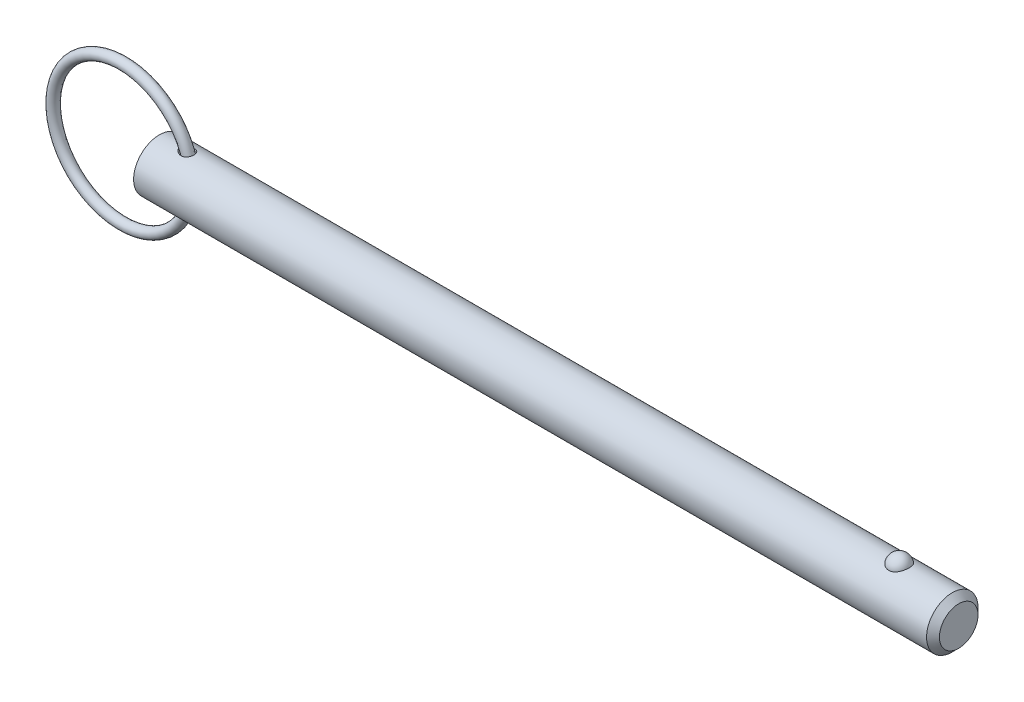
ISO-10303-21;
HEADER;
FILE_DESCRIPTION(('STEP AP214'),'2;1');
FILE_NAME('part.step','',(''),(''),'','','');
FILE_SCHEMA(('AUTOMOTIVE_DESIGN { 1 0 10303 214 1 1 1 1 }'));
ENDSEC;
DATA;
#1=APPLICATION_CONTEXT('core data for automotive mechanical design processes');
#2=APPLICATION_PROTOCOL_DEFINITION('international standard','automotive_design',2000,#1);
#3=PRODUCT_CONTEXT('',#1,'mechanical');
#4=PRODUCT('Part','Part','',(#3));
#5=PRODUCT_RELATED_PRODUCT_CATEGORY('part','',(#4));
#6=PRODUCT_DEFINITION_FORMATION('','',#4);
#7=PRODUCT_DEFINITION_CONTEXT('part definition',#1,'design');
#8=PRODUCT_DEFINITION('design','',#6,#7);
#9=PRODUCT_DEFINITION_SHAPE('','',#8);
#10=(LENGTH_UNIT() NAMED_UNIT(*) SI_UNIT(.MILLI.,.METRE.));
#11=(NAMED_UNIT(*) PLANE_ANGLE_UNIT() SI_UNIT($,.RADIAN.));
#12=(NAMED_UNIT(*) SI_UNIT($,.STERADIAN.) SOLID_ANGLE_UNIT());
#13=UNCERTAINTY_MEASURE_WITH_UNIT(LENGTH_MEASURE(1.E-05),#10,'distance_accuracy_value','');
#14=(GEOMETRIC_REPRESENTATION_CONTEXT(3) GLOBAL_UNCERTAINTY_ASSIGNED_CONTEXT((#13)) GLOBAL_UNIT_ASSIGNED_CONTEXT((#10,
#11,#12)) REPRESENTATION_CONTEXT('',''));
#15=CARTESIAN_POINT('',(0.,0.,0.));
#16=DIRECTION('',(0.,0.,1.));
#17=DIRECTION('',(1.,0.,0.));
#18=AXIS2_PLACEMENT_3D('',#15,#16,#17);
#19=CARTESIAN_POINT('',(-6.70471658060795,0.,0.));
#20=DIRECTION('',(0.,0.,1.));
#21=DIRECTION('',(1.,0.,0.));
#22=AXIS2_PLACEMENT_3D('',#19,#20,#21);
#23=TOROIDAL_SURFACE('',#22,12.7,0.940000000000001);
#24=CARTESIAN_POINT('',(6.93528341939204,0.,0.));
#25=VERTEX_POINT('',#24);
#26=VERTEX_LOOP('',#25);
#27=FACE_BOUND('',#26,.T.);
#28=ADVANCED_FACE('P0_F12',(#27),#23,.T.);
#29=CLOSED_SHELL('',(#28));
#30=MANIFOLD_SOLID_BREP('P0_B1',#29);
#31=CARTESIAN_POINT('',(0.,0.,0.));
#32=DIRECTION('',(1.,0.,0.));
#33=DIRECTION('',(0.,0.,-1.));
#34=AXIS2_PLACEMENT_3D('',#31,#32,#33);
#35=CYLINDRICAL_SURFACE('',#34,4.7);
#36=CARTESIAN_POINT('',(4.16378072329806,4.63584137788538,-0.773934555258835));
#37=CARTESIAN_POINT('',(4.22041228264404,4.62659903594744,-0.829297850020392));
#38=CARTESIAN_POINT('',(4.28206987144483,4.61719767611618,-0.87952289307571));
#39=CARTESIAN_POINT('',(4.41303152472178,4.59925351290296,-0.968997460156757));
#40=CARTESIAN_POINT('',(4.48234424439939,4.59071170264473,-1.00823437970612));
#41=CARTESIAN_POINT('',(4.62650734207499,4.5755493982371,-1.07495006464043));
#42=CARTESIAN_POINT('',(4.70135029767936,4.56892638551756,-1.10244426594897));
#43=CARTESIAN_POINT('',(4.85470490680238,4.55848940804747,-1.14483874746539));
#44=CARTESIAN_POINT('',(4.93321503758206,4.55467428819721,-1.15974420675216));
#45=CARTESIAN_POINT('',(5.09197970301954,4.55051176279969,-1.17597559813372));
#46=CARTESIAN_POINT('',(5.17223836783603,4.55017372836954,-1.17726483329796));
#47=CARTESIAN_POINT('',(5.33159446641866,4.55326696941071,-1.16524823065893));
#48=CARTESIAN_POINT('',(5.41069268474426,4.55669556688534,-1.15195276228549));
#49=CARTESIAN_POINT('',(5.55698758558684,4.56647801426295,-1.11249214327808));
#50=CARTESIAN_POINT('',(5.62458628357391,4.57250771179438,-1.08773548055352));
#51=CARTESIAN_POINT('',(5.7539770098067,4.58665356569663,-1.02644632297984));
#52=CARTESIAN_POINT('',(5.81577171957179,4.59476875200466,-0.989919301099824));
#53=CARTESIAN_POINT('',(5.92681484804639,4.61135052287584,-0.90939126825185));
#54=CARTESIAN_POINT('',(5.97666790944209,4.61973919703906,-0.866204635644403));
#55=CARTESIAN_POINT('',(6.06817854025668,4.63643253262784,-0.771868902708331));
#56=CARTESIAN_POINT('',(6.10983710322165,4.64473720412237,-0.720720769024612));
#57=CARTESIAN_POINT('',(6.18318089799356,4.660174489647,-0.612928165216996));
#58=CARTESIAN_POINT('',(6.21503150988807,4.66732544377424,-0.55639864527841));
#59=CARTESIAN_POINT('',(6.26900210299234,4.67985590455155,-0.438689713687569));
#60=CARTESIAN_POINT('',(6.29112194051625,4.68523538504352,-0.377510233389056));
#61=CARTESIAN_POINT('',(6.3252384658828,4.6936733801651,-0.251831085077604));
#62=CARTESIAN_POINT('',(6.33717189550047,4.69671737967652,-0.187313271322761));
#63=CARTESIAN_POINT('',(6.35042407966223,4.70010386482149,-0.0571258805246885));
#64=CARTESIAN_POINT('',(6.3517424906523,4.70044626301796,0.00854373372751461));
#65=CARTESIAN_POINT('',(6.34371729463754,4.69838816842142,0.139481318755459));
#66=CARTESIAN_POINT('',(6.33432596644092,4.69597539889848,0.204746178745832));
#67=CARTESIAN_POINT('',(6.30500866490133,4.68864655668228,0.332720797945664));
#68=CARTESIAN_POINT('',(6.28508259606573,4.68373046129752,0.395430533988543));
#69=CARTESIAN_POINT('',(6.23516511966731,4.67193431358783,0.516455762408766));
#70=CARTESIAN_POINT('',(6.20518126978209,4.66505573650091,0.574774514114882));
#71=CARTESIAN_POINT('',(6.1358631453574,4.65009270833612,0.685387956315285));
#72=CARTESIAN_POINT('',(6.09652950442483,4.64200833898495,0.737683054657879));
#73=CARTESIAN_POINT('',(6.00979078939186,4.62559001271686,0.834455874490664));
#74=CARTESIAN_POINT('',(5.96243625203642,4.61725787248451,0.878979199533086));
#75=CARTESIAN_POINT('',(5.86079843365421,4.60122574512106,0.959378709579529));
#76=CARTESIAN_POINT('',(5.80651591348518,4.59352568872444,0.995255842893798));
#77=CARTESIAN_POINT('',(5.69277386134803,4.57961669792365,1.05741527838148));
#78=CARTESIAN_POINT('',(5.63333134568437,4.57340309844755,1.08372773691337));
#79=CARTESIAN_POINT('',(5.5108424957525,4.56305640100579,1.12650026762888));
#80=CARTESIAN_POINT('',(5.44779577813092,4.55892352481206,1.14295928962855));
#81=CARTESIAN_POINT('',(5.3179566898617,4.55299444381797,1.1663590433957));
#82=CARTESIAN_POINT('',(5.25110869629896,4.55127026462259,1.17300670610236));
#83=CARTESIAN_POINT('',(5.11716812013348,4.55043953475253,1.17622268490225));
#84=CARTESIAN_POINT('',(5.05007546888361,4.55133378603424,1.17278791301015));
#85=CARTESIAN_POINT('',(4.91166083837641,4.55569951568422,1.15571913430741));
#86=CARTESIAN_POINT('',(4.84044690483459,4.55937764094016,1.1412666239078));
#87=CARTESIAN_POINT('',(4.70108819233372,4.56903562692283,1.10196123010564));
#88=CARTESIAN_POINT('',(4.63294574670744,4.57501720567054,1.07710058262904));
#89=CARTESIAN_POINT('',(4.4947730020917,4.58927184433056,1.01474439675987));
#90=CARTESIAN_POINT('',(4.42520748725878,4.59771156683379,0.976252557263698));
#91=CARTESIAN_POINT('',(4.29354165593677,4.61552030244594,0.888246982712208));
#92=CARTESIAN_POINT('',(4.23143936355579,4.62488906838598,0.838736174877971));
#93=CARTESIAN_POINT('',(4.12609666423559,4.64192969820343,0.738015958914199));
#94=CARTESIAN_POINT('',(4.08142630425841,4.64963595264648,0.68830869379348));
#95=CARTESIAN_POINT('',(4.0008117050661,4.66411457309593,0.582144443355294));
#96=CARTESIAN_POINT('',(3.96485623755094,4.6708881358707,0.525696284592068));
#97=CARTESIAN_POINT('',(3.90818393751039,4.68183565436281,0.415917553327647));
#98=CARTESIAN_POINT('',(3.88599581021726,4.68624644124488,0.363372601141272));
#99=CARTESIAN_POINT('',(3.85055971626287,4.693376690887,0.255230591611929));
#100=CARTESIAN_POINT('',(3.83730635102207,4.69609717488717,0.199635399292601));
#101=CARTESIAN_POINT('',(3.82058225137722,4.69954043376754,0.0867104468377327));
#102=CARTESIAN_POINT('',(3.81714632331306,4.70025610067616,0.0293752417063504));
#103=CARTESIAN_POINT('',(3.8204140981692,4.69957935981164,-0.0849928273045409));
#104=CARTESIAN_POINT('',(3.82711802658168,4.69818690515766,-0.14202568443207));
#105=CARTESIAN_POINT('',(3.84950128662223,4.69360426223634,-0.250744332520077));
#106=CARTESIAN_POINT('',(3.8646389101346,4.69052274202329,-0.302548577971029));
#107=CARTESIAN_POINT('',(3.90261190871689,4.68295207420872,-0.403121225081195));
#108=CARTESIAN_POINT('',(3.92544863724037,4.67846267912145,-0.451889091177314));
#109=CARTESIAN_POINT('',(3.97999306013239,4.6680441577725,-0.549522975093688));
#110=CARTESIAN_POINT('',(4.01228648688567,4.66202553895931,-0.598050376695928));
#111=CARTESIAN_POINT('',(4.08340845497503,4.64931397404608,-0.689954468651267));
#112=CARTESIAN_POINT('',(4.12224260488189,4.64262045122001,-0.733326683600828));
#113=CARTESIAN_POINT('',(4.16378072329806,4.63584137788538,-0.773934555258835));
#114=B_SPLINE_CURVE_WITH_KNOTS('',3,(#36,#37,#38,#39,#40,#41,#42,#43,#44,#45,#46,#47,#48,#49,
#50,#51,#52,#53,#54,#55,#56,#57,#58,#59,#60,#61,#62,#63,#64,#65,#66,#67,#68,#69,#70,#71,#72,#73,
#74,#75,#76,#77,#78,#79,#80,#81,#82,#83,#84,#85,#86,#87,#88,#89,#90,#91,#92,#93,#94,#95,#96,#97,
#98,#99,#100,#101,#102,#103,#104,#105,#106,#107,#108,#109,#110,#111,#112,#113),.UNSPECIFIED.,
.T.,.F.,(4,2,2,2,2,2,2,2,2,2,2,2,2,2,2,2,2,2,2,2,2,2,2,2,2,2,2,2,2,2,2,2,2,2,2,2,2,2,4),(0.,
0.238977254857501,0.478227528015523,0.717162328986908,0.955998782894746,1.19547875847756,
1.43478857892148,1.65034375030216,1.8657988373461,2.06429861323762,2.26277430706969,
2.45769248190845,2.65261353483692,2.848736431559,3.04486567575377,3.24187227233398,
3.43888065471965,3.6357413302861,3.83258866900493,4.02823898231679,4.22386782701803,
4.41887441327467,4.61390177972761,4.81464443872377,5.0154485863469,5.2328283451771,
5.45037055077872,5.68914354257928,5.92785317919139,6.12887730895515,6.32964104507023,
6.50053592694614,6.67132745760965,6.84272375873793,7.0141238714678,7.17560768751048,
7.33711990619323,7.5122540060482,7.68753905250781),.UNSPECIFIED.);
#115=CARTESIAN_POINT('',(4.16378072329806,4.63584137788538,-0.773934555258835));
#116=VERTEX_POINT('',#115);
#117=EDGE_CURVE('P1_E40',#116,#116,#114,.T.);
#118=ORIENTED_EDGE('',*,*,#117,.T.);
#119=EDGE_LOOP('',(#118));
#120=FACE_BOUND('',#119,.T.);
#121=CARTESIAN_POINT('',(144.875,0.,0.));
#122=DIRECTION('',(1.,0.,0.));
#123=DIRECTION('',(0.,0.,-1.));
#124=AXIS2_PLACEMENT_3D('',#121,#122,#123);
#125=CIRCLE('',#124,4.7);
#126=CARTESIAN_POINT('',(144.875,0.,-4.7));
#127=VERTEX_POINT('',#126);
#128=EDGE_CURVE('P1_E25',#127,#127,#125,.T.);
#129=ORIENTED_EDGE('',*,*,#128,.F.);
#130=EDGE_LOOP('',(#129));
#131=FACE_BOUND('',#130,.T.);
#132=CARTESIAN_POINT('',(0.,0.,0.));
#133=DIRECTION('',(1.,0.,0.));
#134=DIRECTION('',(0.,0.,-1.));
#135=AXIS2_PLACEMENT_3D('',#132,#133,#134);
#136=CIRCLE('',#135,4.7);
#137=CARTESIAN_POINT('',(0.,0.,-4.7));
#138=VERTEX_POINT('',#137);
#139=EDGE_CURVE('P1_E9',#138,#138,#136,.T.);
#140=ORIENTED_EDGE('',*,*,#139,.T.);
#141=EDGE_LOOP('',(#140));
#142=FACE_BOUND('',#141,.T.);
#143=CARTESIAN_POINT('',(135.18062830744,4.30387706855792,1.88855557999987));
#144=CARTESIAN_POINT('',(135.082813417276,4.30388592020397,1.88854684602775));
#145=CARTESIAN_POINT('',(134.984851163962,4.30731231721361,1.88078712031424));
#146=CARTESIAN_POINT('',(134.791662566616,4.32065009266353,1.84993192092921));
#147=CARTESIAN_POINT('',(134.696443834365,4.33057798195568,1.82679740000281));
#148=CARTESIAN_POINT('',(134.51181755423,4.3557457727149,1.76594245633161));
#149=CARTESIAN_POINT('',(134.422395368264,4.37097162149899,1.72826059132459));
#150=CARTESIAN_POINT('',(134.251390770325,4.4050778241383,1.6393730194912));
#151=CARTESIAN_POINT('',(134.169805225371,4.42395670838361,1.58817274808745));
#152=CARTESIAN_POINT('',(134.013901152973,4.46404088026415,1.47181116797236));
#153=CARTESIAN_POINT('',(133.939875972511,4.48529915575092,1.40627540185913));
#154=CARTESIAN_POINT('',(133.803536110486,4.527485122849,1.26387806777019));
#155=CARTESIAN_POINT('',(133.741224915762,4.54841271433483,1.18701313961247));
#156=CARTESIAN_POINT('',(133.627072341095,4.58876216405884,1.02025841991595));
#157=CARTESIAN_POINT('',(133.575811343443,4.60807744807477,0.929944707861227));
#158=CARTESIAN_POINT('',(133.48842456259,4.6421320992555,0.741468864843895));
#159=CARTESIAN_POINT('',(133.452299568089,4.65687122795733,0.643306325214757));
#160=CARTESIAN_POINT('',(133.395671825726,4.68038485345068,0.440967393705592));
#161=CARTESIAN_POINT('',(133.375304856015,4.68910744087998,0.336746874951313));
#162=CARTESIAN_POINT('',(133.351132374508,4.69949255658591,0.126059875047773));
#163=CARTESIAN_POINT('',(133.347326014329,4.70115544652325,0.0195935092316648));
#164=CARTESIAN_POINT('',(133.356308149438,4.69727256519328,-0.191500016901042));
#165=CARTESIAN_POINT('',(133.368941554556,4.69179416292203,-0.296135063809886));
#166=CARTESIAN_POINT('',(133.410276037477,4.67429351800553,-0.501612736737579));
#167=CARTESIAN_POINT('',(133.438977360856,4.66227117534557,-0.602455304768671));
#168=CARTESIAN_POINT('',(133.511928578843,4.63286427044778,-0.797707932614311));
#169=CARTESIAN_POINT('',(133.556204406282,4.61547077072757,-0.892106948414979));
#170=CARTESIAN_POINT('',(133.659407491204,4.5770990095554,-1.07173134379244));
#171=CARTESIAN_POINT('',(133.718336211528,4.55612039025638,-1.15695580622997));
#172=CARTESIAN_POINT('',(133.850216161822,4.51257918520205,-1.31664252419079));
#173=CARTESIAN_POINT('',(133.923286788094,4.49000423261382,-1.39100294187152));
#174=CARTESIAN_POINT('',(134.081478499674,4.44594443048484,-1.52598548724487));
#175=CARTESIAN_POINT('',(134.166599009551,4.42445952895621,-1.58660827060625));
#176=CARTESIAN_POINT('',(134.345267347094,4.38543655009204,-1.69145998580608));
#177=CARTESIAN_POINT('',(134.438651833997,4.36783887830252,-1.73594433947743));
#178=CARTESIAN_POINT('',(134.63242205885,4.3382941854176,-1.80852276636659));
#179=CARTESIAN_POINT('',(134.732805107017,4.32634500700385,-1.83662309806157));
#180=CARTESIAN_POINT('',(134.93228752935,4.31005085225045,-1.87453136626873));
#181=CARTESIAN_POINT('',(135.031196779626,4.30535309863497,-1.88518956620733));
#182=CARTESIAN_POINT('',(135.229521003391,4.30299844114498,-1.89055986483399));
#183=CARTESIAN_POINT('',(135.328935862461,4.30534000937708,-1.88527542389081));
#184=CARTESIAN_POINT('',(135.52186386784,4.31657737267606,-1.85939299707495));
#185=CARTESIAN_POINT('',(135.615462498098,4.32524571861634,-1.83932621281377));
#186=CARTESIAN_POINT('',(135.797783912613,4.34791518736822,-1.78507441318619));
#187=CARTESIAN_POINT('',(135.886506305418,4.36191673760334,-1.7508882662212));
#188=CARTESIAN_POINT('',(136.058694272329,4.39411605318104,-1.66845234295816));
#189=CARTESIAN_POINT('',(136.142008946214,4.41239631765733,-1.61992036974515));
#190=CARTESIAN_POINT('',(136.299399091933,4.45109244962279,-1.51034589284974));
#191=CARTESIAN_POINT('',(136.373472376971,4.47150882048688,-1.44930043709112));
#192=CARTESIAN_POINT('',(136.514405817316,4.51353865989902,-1.3127519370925));
#193=CARTESIAN_POINT('',(136.580701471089,4.53515983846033,-1.23666813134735));
#194=CARTESIAN_POINT('',(136.700069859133,4.57635116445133,-1.07425533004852));
#195=CARTESIAN_POINT('',(136.75314024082,4.5959209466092,-0.987924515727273));
#196=CARTESIAN_POINT('',(136.846443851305,4.63161819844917,-0.804428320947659));
#197=CARTESIAN_POINT('',(136.886229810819,4.64762063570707,-0.707010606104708));
#198=CARTESIAN_POINT('',(136.949825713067,4.67374032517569,-0.506344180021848));
#199=CARTESIAN_POINT('',(136.973635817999,4.68385763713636,-0.403095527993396));
#200=CARTESIAN_POINT('',(137.004751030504,4.69716075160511,-0.19397572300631));
#201=CARTESIAN_POINT('',(137.012098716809,4.70036443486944,-0.0881120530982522));
#202=CARTESIAN_POINT('',(137.010261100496,4.6995691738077,0.12344125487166));
#203=CARTESIAN_POINT('',(137.001076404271,4.69557049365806,0.229130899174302));
#204=CARTESIAN_POINT('',(136.966492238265,4.68082941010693,0.436545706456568));
#205=CARTESIAN_POINT('',(136.941209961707,4.67013575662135,0.538293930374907));
#206=CARTESIAN_POINT('',(136.875050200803,4.64311776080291,0.735797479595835));
#207=CARTESIAN_POINT('',(136.834171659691,4.62679303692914,0.831552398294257));
#208=CARTESIAN_POINT('',(136.737286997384,4.5900271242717,1.01512750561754));
#209=CARTESIAN_POINT('',(136.681173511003,4.56955699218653,1.10288523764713));
#210=CARTESIAN_POINT('',(136.55510852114,4.52671789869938,1.26730106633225));
#211=CARTESIAN_POINT('',(136.485157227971,4.50434896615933,1.3439593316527));
#212=CARTESIAN_POINT('',(136.332724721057,4.46008413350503,1.48428028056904));
#213=CARTESIAN_POINT('',(136.250209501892,4.43818970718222,1.54790656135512));
#214=CARTESIAN_POINT('',(136.074735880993,4.39746476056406,1.66008504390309));
#215=CARTESIAN_POINT('',(135.981773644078,4.37863537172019,1.70863168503));
#216=CARTESIAN_POINT('',(135.791099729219,4.34688784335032,1.78783023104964));
#217=CARTESIAN_POINT('',(135.693629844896,4.33380220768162,1.81899757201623));
#218=CARTESIAN_POINT('',(135.494405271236,4.31435159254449,1.86467392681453));
#219=CARTESIAN_POINT('',(135.392663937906,4.30796708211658,1.87923136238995));
#220=CARTESIAN_POINT('',(135.25391360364,4.3043503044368,1.8874737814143));
#221=CARTESIAN_POINT('',(135.21728130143,4.30387375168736,1.8885588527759));
#222=CARTESIAN_POINT('',(135.18062830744,4.30387706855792,1.88855557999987));
#223=B_SPLINE_CURVE_WITH_KNOTS('',3,(#143,#144,#145,#146,#147,#148,#149,#150,#151,#152,#153,
#154,#155,#156,#157,#158,#159,#160,#161,#162,#163,#164,#165,#166,#167,#168,#169,#170,#171,#172,
#173,#174,#175,#176,#177,#178,#179,#180,#181,#182,#183,#184,#185,#186,#187,#188,#189,#190,#191,
#192,#193,#194,#195,#196,#197,#198,#199,#200,#201,#202,#203,#204,#205,#206,#207,#208,#209,#210,
#211,#212,#213,#214,#215,#216,#217,#218,#219,#220,#221,#222),.UNSPECIFIED.,.T.,.F.,(4,2,2,2,2,2,
2,2,2,2,2,2,2,2,2,2,2,2,2,2,2,2,2,2,2,2,2,2,2,2,2,2,2,2,2,2,2,2,2,4),(0.,0.293339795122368,
0.587427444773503,0.880740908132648,1.17393661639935,1.47597417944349,1.77810150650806,
2.09350493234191,2.40892479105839,2.72703308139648,3.04512507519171,3.36023788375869,
3.67535550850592,3.9910003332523,4.30667668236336,4.62514463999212,4.94359739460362,
5.25676407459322,5.56981105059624,5.86708641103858,6.16429725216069,6.45131888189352,
6.73836351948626,7.03148013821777,7.3246659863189,7.63288296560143,7.94115473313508,
8.25895074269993,8.57674352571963,8.89371340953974,9.21067166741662,9.52534839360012,
9.84004644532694,10.1570225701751,10.4739938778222,10.7918388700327,11.1098009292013,
11.4177488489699,11.7247967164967,11.834716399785),.UNSPECIFIED.);
#224=CARTESIAN_POINT('',(135.18062830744,4.30387706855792,1.88855557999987));
#225=VERTEX_POINT('',#224);
#226=EDGE_CURVE('P1_E34',#225,#225,#223,.T.);
#227=ORIENTED_EDGE('',*,*,#226,.T.);
#228=EDGE_LOOP('',(#227));
#229=FACE_BOUND('',#228,.T.);
#230=CARTESIAN_POINT('',(4.16378072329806,-4.63584137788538,-0.773934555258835));
#231=CARTESIAN_POINT('',(4.11797605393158,-4.64331682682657,-0.729154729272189));
#232=CARTESIAN_POINT('',(4.07545237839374,-4.65068929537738,-0.681007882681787));
#233=CARTESIAN_POINT('',(3.99850919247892,-4.66454993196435,-0.578483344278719));
#234=CARTESIAN_POINT('',(3.96408464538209,-4.67103864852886,-0.524109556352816));
#235=CARTESIAN_POINT('',(3.90486465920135,-4.68247538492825,-0.409579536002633));
#236=CARTESIAN_POINT('',(3.88014787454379,-4.68741075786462,-0.349380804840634));
#237=CARTESIAN_POINT('',(3.84254060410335,-4.69500854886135,-0.225256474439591));
#238=CARTESIAN_POINT('',(3.82963753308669,-4.69767338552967,-0.161334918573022));
#239=CARTESIAN_POINT('',(3.81750619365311,-4.70018000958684,-0.0396774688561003));
#240=CARTESIAN_POINT('',(3.8168623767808,-4.70031401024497,0.0179134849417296));
#241=CARTESIAN_POINT('',(3.82570055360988,-4.69848615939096,0.132270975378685));
#242=CARTESIAN_POINT('',(3.83518142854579,-4.6965245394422,0.189037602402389));
#243=CARTESIAN_POINT('',(3.8627670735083,-4.69091189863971,0.296808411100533));
#244=CARTESIAN_POINT('',(3.88034293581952,-4.68736483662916,0.347956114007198));
#245=CARTESIAN_POINT('',(3.92293217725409,-4.67896699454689,0.446919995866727));
#246=CARTESIAN_POINT('',(3.94794743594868,-4.67411588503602,0.494735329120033));
#247=CARTESIAN_POINT('',(4.00723361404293,-4.66297432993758,0.590975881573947));
#248=CARTESIAN_POINT('',(4.04218787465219,-4.65658759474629,0.63896688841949));
#249=CARTESIAN_POINT('',(4.11850165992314,-4.64327412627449,0.729452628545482));
#250=CARTESIAN_POINT('',(4.15986486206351,-4.63634708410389,0.771944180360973));
#251=CARTESIAN_POINT('',(4.25563139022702,-4.62124878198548,0.858077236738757));
#252=CARTESIAN_POINT('',(4.3110472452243,-4.61307408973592,0.900593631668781));
#253=CARTESIAN_POINT('',(4.42760239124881,-4.59748077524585,0.977085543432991));
#254=CARTESIAN_POINT('',(4.48874590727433,-4.59006271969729,1.01105468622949));
#255=CARTESIAN_POINT('',(4.62409915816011,-4.5757760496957,1.07399161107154));
#256=CARTESIAN_POINT('',(4.69895162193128,-4.56912175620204,1.10163764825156));
#257=CARTESIAN_POINT('',(4.85238616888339,-4.55861611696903,1.14433682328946));
#258=CARTESIAN_POINT('',(4.93096882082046,-4.55476520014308,1.15938803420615));
#259=CARTESIAN_POINT('',(5.08983848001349,-4.55053674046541,1.17587995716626));
#260=CARTESIAN_POINT('',(5.17012835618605,-4.55016559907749,1.17729558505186));
#261=CARTESIAN_POINT('',(5.32956049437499,-4.55319561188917,1.16552635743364));
#262=CARTESIAN_POINT('',(5.40870366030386,-4.55659361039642,1.15235371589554));
#263=CARTESIAN_POINT('',(5.55512154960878,-4.56632591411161,1.11311448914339));
#264=CARTESIAN_POINT('',(5.62279525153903,-4.57233592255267,1.08845479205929));
#265=CARTESIAN_POINT('',(5.75235194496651,-4.58645252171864,1.02734156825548));
#266=CARTESIAN_POINT('',(5.81423750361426,-4.59455817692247,0.990893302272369));
#267=CARTESIAN_POINT('',(5.92544729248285,-4.61112960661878,0.910507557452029));
#268=CARTESIAN_POINT('',(5.9753775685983,-4.61951638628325,0.867388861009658));
#269=CARTESIAN_POINT('',(6.06705041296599,-4.63621447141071,0.773173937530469));
#270=CARTESIAN_POINT('',(6.10879399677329,-4.64452578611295,0.722078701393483));
#271=CARTESIAN_POINT('',(6.18230323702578,-4.65998194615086,0.614385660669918));
#272=CARTESIAN_POINT('',(6.21423602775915,-4.66714520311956,0.557904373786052));
#273=CARTESIAN_POINT('',(6.26837651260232,-4.67970630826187,0.440277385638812));
#274=CARTESIAN_POINT('',(6.29058407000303,-4.68510413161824,0.379131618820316));
#275=CARTESIAN_POINT('',(6.32487950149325,-4.69358284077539,0.253506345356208));
#276=CARTESIAN_POINT('',(6.33690441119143,-4.69664929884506,0.189008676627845));
#277=CARTESIAN_POINT('',(6.35034148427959,-4.70008248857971,0.05884554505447));
#278=CARTESIAN_POINT('',(6.35175330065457,-4.70044913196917,-0.00681995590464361));
#279=CARTESIAN_POINT('',(6.34391515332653,-4.69843881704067,-0.137767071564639));
#280=CARTESIAN_POINT('',(6.33461722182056,-4.69604951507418,-0.203045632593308));
#281=CARTESIAN_POINT('',(6.30548404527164,-4.68876413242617,-0.331063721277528));
#282=CARTESIAN_POINT('',(6.28564870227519,-4.68386802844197,-0.393803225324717));
#283=CARTESIAN_POINT('',(6.23590713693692,-4.67210599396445,-0.514904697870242));
#284=CARTESIAN_POINT('',(6.20600824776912,-4.66524149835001,-0.573269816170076));
#285=CARTESIAN_POINT('',(6.13685224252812,-4.65029918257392,-0.683989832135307));
#286=CARTESIAN_POINT('',(6.09759575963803,-4.6422214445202,-0.736345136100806));
#287=CARTESIAN_POINT('',(6.01099960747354,-4.62580793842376,-0.833250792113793));
#288=CARTESIAN_POINT('',(5.963710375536,-4.61747403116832,-0.877846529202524));
#289=CARTESIAN_POINT('',(5.8621900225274,-4.60143050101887,-0.958399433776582));
#290=CARTESIAN_POINT('',(5.80795966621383,-4.59372080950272,-0.99435755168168));
#291=CARTESIAN_POINT('',(5.69431062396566,-4.57978661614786,-1.05668157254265));
#292=CARTESIAN_POINT('',(5.63490936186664,-4.57355737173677,-1.08307825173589));
#293=CARTESIAN_POINT('',(5.51248756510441,-4.56317492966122,-1.12602176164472));
#294=CARTESIAN_POINT('',(5.44946662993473,-4.55902196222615,-1.1425675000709));
#295=CARTESIAN_POINT('',(5.31967752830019,-4.55305083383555,-1.16613984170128));
#296=CARTESIAN_POINT('',(5.25285368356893,-4.55130415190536,-1.17287534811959));
#297=CARTESIAN_POINT('',(5.11894995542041,-4.55042807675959,-1.17626714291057));
#298=CARTESIAN_POINT('',(5.05187000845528,-4.55129938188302,-1.17292074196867));
#299=CARTESIAN_POINT('',(4.91348721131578,-4.55561850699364,-1.15603764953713));
#300=CARTESIAN_POINT('',(4.84229084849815,-4.55927235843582,-1.14168541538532));
#301=CARTESIAN_POINT('',(4.70293860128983,-4.56888540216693,-1.10258192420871));
#302=CARTESIAN_POINT('',(4.63478566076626,-4.57484677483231,-1.07782082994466));
#303=CARTESIAN_POINT('',(4.49401200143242,-4.58932889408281,-1.01452290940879));
#304=CARTESIAN_POINT('',(4.42204931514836,-4.59808779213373,-0.974568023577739));
#305=CARTESIAN_POINT('',(4.28620227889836,-4.61656806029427,-0.882881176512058));
#306=CARTESIAN_POINT('',(4.22231268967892,-4.62628879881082,-0.831156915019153));
#307=CARTESIAN_POINT('',(4.16378072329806,-4.63584137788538,-0.773934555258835));
#308=B_SPLINE_CURVE_WITH_KNOTS('',3,(#230,#231,#232,#233,#234,#235,#236,#237,#238,#239,#240,
#241,#242,#243,#244,#245,#246,#247,#248,#249,#250,#251,#252,#253,#254,#255,#256,#257,#258,#259,
#260,#261,#262,#263,#264,#265,#266,#267,#268,#269,#270,#271,#272,#273,#274,#275,#276,#277,#278,
#279,#280,#281,#282,#283,#284,#285,#286,#287,#288,#289,#290,#291,#292,#293,#294,#295,#296,#297,
#298,#299,#300,#301,#302,#303,#304,#305,#306,#307),.UNSPECIFIED.,.T.,.F.,(4,2,2,2,2,2,2,2,2,2,2,
2,2,2,2,2,2,2,2,2,2,2,2,2,2,2,2,2,2,2,2,2,2,2,2,2,2,2,4),(0.,0.193263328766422,
0.386406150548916,0.581083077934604,0.775552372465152,0.947410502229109,1.11924964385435,
1.28117818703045,1.44314767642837,1.62161944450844,1.80019400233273,2.01034324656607,
2.22064874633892,2.45975127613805,2.69889038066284,2.93846932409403,3.1778478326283,
3.39350806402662,3.6090721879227,3.8076122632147,4.00612769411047,4.20104508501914,
4.39596521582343,4.59208201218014,4.78820522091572,4.98521027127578,5.18221715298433,
5.37908078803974,5.57593110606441,5.7715882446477,5.96722384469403,6.1622240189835,
6.35724581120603,6.55794420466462,6.75869613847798,6.97596054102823,7.1934307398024,
7.44055547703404,7.68751900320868),.UNSPECIFIED.);
#309=CARTESIAN_POINT('',(4.16378072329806,-4.63584137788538,-0.773934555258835));
#310=VERTEX_POINT('',#309);
#311=EDGE_CURVE('P1_E17',#310,#310,#308,.T.);
#312=ORIENTED_EDGE('',*,*,#311,.T.);
#313=EDGE_LOOP('',(#312));
#314=FACE_BOUND('',#313,.T.);
#315=ADVANCED_FACE('P1_F13',(#120,#131,#142,#229,#314),#35,.T.);
#316=CARTESIAN_POINT('',(0.,0.,0.));
#317=DIRECTION('',(-1.,0.,0.));
#318=DIRECTION('',(0.,0.,1.));
#319=AXIS2_PLACEMENT_3D('',#316,#317,#318);
#320=PLANE('',#319);
#321=ORIENTED_EDGE('',*,*,#139,.F.);
#322=EDGE_LOOP('',(#321));
#323=FACE_BOUND('',#322,.T.);
#324=ADVANCED_FACE('P1_F15',(#323),#320,.T.);
#325=CARTESIAN_POINT('',(146.05,0.,0.));
#326=DIRECTION('',(-1.,0.,0.));
#327=DIRECTION('',(0.,0.,1.));
#328=AXIS2_PLACEMENT_3D('',#325,#326,#327);
#329=CONICAL_SURFACE('',#328,3.52500000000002,0.785398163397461);
#330=ORIENTED_EDGE('',*,*,#128,.T.);
#331=EDGE_LOOP('',(#330));
#332=FACE_BOUND('',#331,.T.);
#333=CARTESIAN_POINT('',(146.05,0.,0.));
#334=DIRECTION('',(1.,0.,0.));
#335=DIRECTION('',(0.,0.,-1.));
#336=AXIS2_PLACEMENT_3D('',#333,#334,#335);
#337=CIRCLE('',#336,3.52500000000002);
#338=CARTESIAN_POINT('',(146.05,0.,-3.52500000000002));
#339=VERTEX_POINT('',#338);
#340=EDGE_CURVE('P1_E30',#339,#339,#337,.T.);
#341=ORIENTED_EDGE('',*,*,#340,.F.);
#342=EDGE_LOOP('',(#341));
#343=FACE_BOUND('',#342,.T.);
#344=ADVANCED_FACE('P1_F55',(#332,#343),#329,.T.);
#345=CARTESIAN_POINT('',(146.05,3.52500000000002,0.));
#346=DIRECTION('',(1.,0.,0.));
#347=DIRECTION('',(0.,0.,-1.));
#348=AXIS2_PLACEMENT_3D('',#345,#346,#347);
#349=PLANE('',#348);
#350=ORIENTED_EDGE('',*,*,#340,.T.);
#351=EDGE_LOOP('',(#350));
#352=FACE_BOUND('',#351,.T.);
#353=ADVANCED_FACE('P1_F51',(#352),#349,.T.);
#354=CARTESIAN_POINT('',(135.18062830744,4.23,0.));
#355=DIRECTION('',(-1.,0.,0.));
#356=DIRECTION('',(0.,1.,0.));
#357=AXIS2_PLACEMENT_3D('',#354,#355,#356);
#358=SPHERICAL_SURFACE('',#357,1.89);
#359=ORIENTED_EDGE('',*,*,#226,.F.);
#360=EDGE_LOOP('',(#359));
#361=FACE_BOUND('',#360,.T.);
#362=ADVANCED_FACE('P1_F46',(#361),#358,.T.);
#363=CARTESIAN_POINT('',(-6.70471658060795,0.,0.));
#364=DIRECTION('',(0.,0.,1.));
#365=DIRECTION('',(1.,0.,0.));
#366=AXIS2_PLACEMENT_3D('',#363,#364,#365);
#367=TOROIDAL_SURFACE('',#366,12.7,1.175);
#368=ORIENTED_EDGE('',*,*,#311,.F.);
#369=EDGE_LOOP('',(#368));
#370=FACE_BOUND('',#369,.T.);
#371=ORIENTED_EDGE('',*,*,#117,.F.);
#372=EDGE_LOOP('',(#371));
#373=FACE_BOUND('',#372,.T.);
#374=ADVANCED_FACE('P1_F50',(#370,#373),#367,.F.);
#375=CLOSED_SHELL('',(#315,#324,#344,#353,#362,#374));
#376=MANIFOLD_SOLID_BREP('P1_B1',#375);
#377=ADVANCED_BREP_SHAPE_REPRESENTATION('',(#18,#30,#376),#14);
#378=SHAPE_DEFINITION_REPRESENTATION(#9,#377);
ENDSEC;
END-ISO-10303-21;
